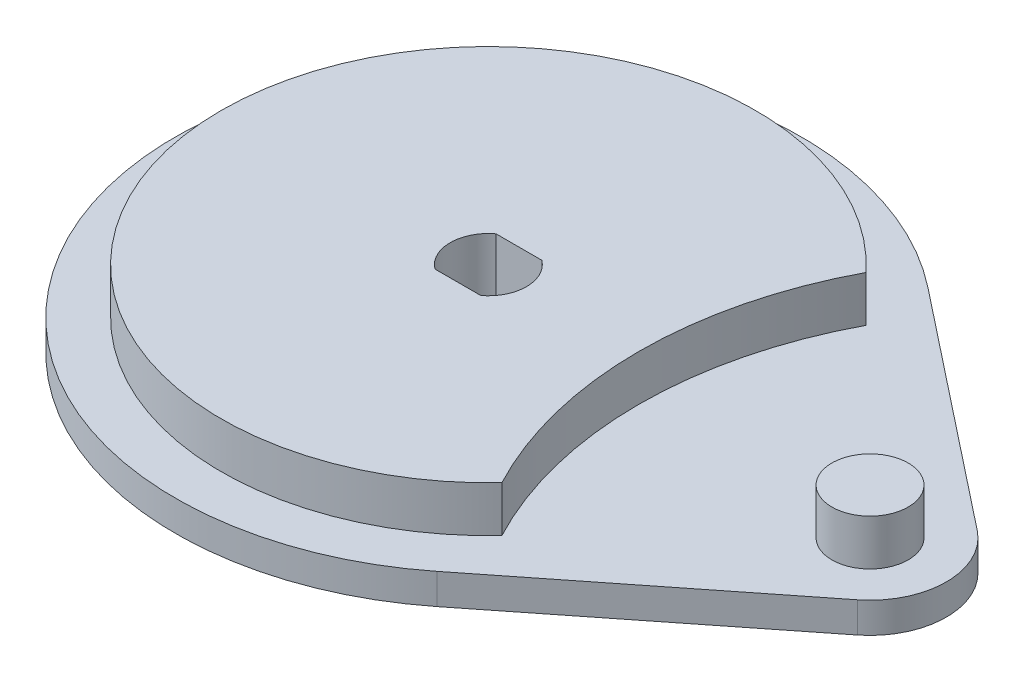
ISO-10303-21;
HEADER;
FILE_DESCRIPTION(('STEP AP214'),'2;1');
FILE_NAME('part.step','',(''),(''),'','','');
FILE_SCHEMA(('AUTOMOTIVE_DESIGN { 1 0 10303 214 1 1 1 1 }'));
ENDSEC;
DATA;
#1=APPLICATION_CONTEXT('core data for automotive mechanical design processes');
#2=APPLICATION_PROTOCOL_DEFINITION('international standard','automotive_design',2000,#1);
#3=PRODUCT_CONTEXT('',#1,'mechanical');
#4=PRODUCT('Part','Part','',(#3));
#5=PRODUCT_RELATED_PRODUCT_CATEGORY('part','',(#4));
#6=PRODUCT_DEFINITION_FORMATION('','',#4);
#7=PRODUCT_DEFINITION_CONTEXT('part definition',#1,'design');
#8=PRODUCT_DEFINITION('design','',#6,#7);
#9=PRODUCT_DEFINITION_SHAPE('','',#8);
#10=(LENGTH_UNIT() NAMED_UNIT(*) SI_UNIT(.MILLI.,.METRE.));
#11=(NAMED_UNIT(*) PLANE_ANGLE_UNIT() SI_UNIT($,.RADIAN.));
#12=(NAMED_UNIT(*) SI_UNIT($,.STERADIAN.) SOLID_ANGLE_UNIT());
#13=UNCERTAINTY_MEASURE_WITH_UNIT(LENGTH_MEASURE(1.E-05),#10,'distance_accuracy_value','');
#14=(GEOMETRIC_REPRESENTATION_CONTEXT(3) GLOBAL_UNCERTAINTY_ASSIGNED_CONTEXT((#13)) GLOBAL_UNIT_ASSIGNED_CONTEXT((#10,
#11,#12)) REPRESENTATION_CONTEXT('',''));
#15=CARTESIAN_POINT('',(0.,0.,0.));
#16=DIRECTION('',(0.,0.,1.));
#17=DIRECTION('',(1.,0.,0.));
#18=AXIS2_PLACEMENT_3D('',#15,#16,#17);
#19=CARTESIAN_POINT('',(0.,4.,0.));
#20=DIRECTION('',(0.,1.,0.));
#21=DIRECTION('',(0.,0.,1.));
#22=AXIS2_PLACEMENT_3D('',#19,#20,#21);
#23=PLANE('',#22);
#24=DIRECTION('',(-0.784601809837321,0.,-0.62));
#25=VECTOR('',#24,1.);
#26=CARTESIAN_POINT('',(25.42,4.,-32.1686742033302));
#27=LINE('',#26,#25);
#28=CARTESIAN_POINT('',(56.2,4.,-7.84601809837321));
#29=VERTEX_POINT('',#28);
#30=CARTESIAN_POINT('',(25.42,4.,-32.1686742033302));
#31=VERTEX_POINT('',#30);
#32=EDGE_CURVE('E177',#29,#31,#27,.T.);
#33=ORIENTED_EDGE('',*,*,#32,.T.);
#34=CARTESIAN_POINT('',(0.,4.,0.));
#35=DIRECTION('',(0.,1.,0.));
#36=DIRECTION('',(0.,0.,1.));
#37=AXIS2_PLACEMENT_3D('',#34,#35,#36);
#38=CIRCLE('',#37,41.);
#39=CARTESIAN_POINT('',(25.42,4.,32.1686742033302));
#40=VERTEX_POINT('',#39);
#41=EDGE_CURVE('E169',#31,#40,#38,.T.);
#42=ORIENTED_EDGE('',*,*,#41,.T.);
#43=DIRECTION('',(0.784601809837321,0.,-0.62));
#44=VECTOR('',#43,1.);
#45=CARTESIAN_POINT('',(56.2,4.,7.8460180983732));
#46=LINE('',#45,#44);
#47=CARTESIAN_POINT('',(56.2,4.,7.84601809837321));
#48=VERTEX_POINT('',#47);
#49=EDGE_CURVE('E172',#40,#48,#46,.T.);
#50=ORIENTED_EDGE('',*,*,#49,.T.);
#51=CARTESIAN_POINT('',(50.,4.,0.));
#52=DIRECTION('',(0.,1.,0.));
#53=DIRECTION('',(0.,0.,1.));
#54=AXIS2_PLACEMENT_3D('',#51,#52,#53);
#55=CIRCLE('',#54,9.99999999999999);
#56=EDGE_CURVE('E175',#48,#29,#55,.T.);
#57=ORIENTED_EDGE('',*,*,#56,.T.);
#58=EDGE_LOOP('',(#33,#42,#50,#57));
#59=FACE_BOUND('',#58,.T.);
#60=CARTESIAN_POINT('',(0.,4.,0.));
#61=DIRECTION('',(0.,1.,0.));
#62=DIRECTION('',(0.,0.,1.));
#63=AXIS2_PLACEMENT_3D('',#60,#61,#62);
#64=CIRCLE('',#63,35.);
#65=CARTESIAN_POINT('',(25.6187411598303,4.,23.8470145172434));
#66=VERTEX_POINT('',#65);
#67=CARTESIAN_POINT('',(25.6187411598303,4.,-23.8470145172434));
#68=VERTEX_POINT('',#67);
#69=EDGE_CURVE('E165',#66,#68,#64,.F.);
#70=ORIENTED_EDGE('',*,*,#69,.T.);
#71=CARTESIAN_POINT('',(70.7,4.,0.));
#72=DIRECTION('',(0.,1.,0.));
#73=DIRECTION('',(0.,0.,1.));
#74=AXIS2_PLACEMENT_3D('',#71,#72,#73);
#75=CIRCLE('',#74,51.);
#76=EDGE_CURVE('E154',#66,#68,#75,.F.);
#77=ORIENTED_EDGE('',*,*,#76,.F.);
#78=EDGE_LOOP('',(#70,#77));
#79=FACE_BOUND('',#78,.T.);
#80=CARTESIAN_POINT('',(50.,4.,0.));
#81=DIRECTION('',(0.,1.,0.));
#82=DIRECTION('',(0.,0.,1.));
#83=AXIS2_PLACEMENT_3D('',#80,#81,#82);
#84=CIRCLE('',#83,5.);
#85=CARTESIAN_POINT('',(50.,4.,5.));
#86=VERTEX_POINT('',#85);
#87=EDGE_CURVE('E149',#86,#86,#84,.F.);
#88=ORIENTED_EDGE('',*,*,#87,.T.);
#89=EDGE_LOOP('',(#88));
#90=FACE_BOUND('',#89,.T.);
#91=ADVANCED_FACE('F33',(#59,#79,#90),#23,.T.);
#92=CARTESIAN_POINT('',(0.,4.,0.));
#93=DIRECTION('',(0.,-1.,0.));
#94=DIRECTION('',(0.,0.,-1.));
#95=AXIS2_PLACEMENT_3D('',#92,#93,#94);
#96=CYLINDRICAL_SURFACE('',#95,41.);
#97=CARTESIAN_POINT('',(0.,0.,0.));
#98=DIRECTION('',(0.,1.,0.));
#99=DIRECTION('',(0.,0.,1.));
#100=AXIS2_PLACEMENT_3D('',#97,#98,#99);
#101=CIRCLE('',#100,41.);
#102=CARTESIAN_POINT('',(25.42,0.,-32.1686742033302));
#103=VERTEX_POINT('',#102);
#104=CARTESIAN_POINT('',(25.42,0.,32.1686742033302));
#105=VERTEX_POINT('',#104);
#106=EDGE_CURVE('E168',#103,#105,#101,.T.);
#107=ORIENTED_EDGE('',*,*,#106,.T.);
#108=DIRECTION('',(0.,-1.,0.));
#109=VECTOR('',#108,1.);
#110=CARTESIAN_POINT('',(25.42,4.,32.1686742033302));
#111=LINE('',#110,#109);
#112=EDGE_CURVE('E11',#40,#105,#111,.T.);
#113=ORIENTED_EDGE('',*,*,#112,.F.);
#114=ORIENTED_EDGE('',*,*,#41,.F.);
#115=DIRECTION('',(0.,-1.,0.));
#116=VECTOR('',#115,1.);
#117=CARTESIAN_POINT('',(25.42,4.,-32.1686742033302));
#118=LINE('',#117,#116);
#119=EDGE_CURVE('E179',#31,#103,#118,.T.);
#120=ORIENTED_EDGE('',*,*,#119,.T.);
#121=EDGE_LOOP('',(#107,#113,#114,#120));
#122=FACE_BOUND('',#121,.T.);
#123=ADVANCED_FACE('F35',(#122),#96,.T.);
#124=CARTESIAN_POINT('',(56.2,4.,7.8460180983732));
#125=DIRECTION('',(-0.62,0.,-0.784601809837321));
#126=DIRECTION('',(-0.784601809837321,0.,0.62));
#127=AXIS2_PLACEMENT_3D('',#124,#125,#126);
#128=PLANE('',#127);
#129=DIRECTION('',(0.784601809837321,0.,-0.62));
#130=VECTOR('',#129,1.);
#131=CARTESIAN_POINT('',(56.2,0.,7.8460180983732));
#132=LINE('',#131,#130);
#133=CARTESIAN_POINT('',(56.2,0.,7.84601809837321));
#134=VERTEX_POINT('',#133);
#135=EDGE_CURVE('E182',#105,#134,#132,.T.);
#136=ORIENTED_EDGE('',*,*,#135,.T.);
#137=DIRECTION('',(0.,-1.,0.));
#138=VECTOR('',#137,1.);
#139=CARTESIAN_POINT('',(56.2,4.,7.84601809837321));
#140=LINE('',#139,#138);
#141=EDGE_CURVE('E41',#48,#134,#140,.T.);
#142=ORIENTED_EDGE('',*,*,#141,.F.);
#143=ORIENTED_EDGE('',*,*,#49,.F.);
#144=ORIENTED_EDGE('',*,*,#112,.T.);
#145=EDGE_LOOP('',(#136,#142,#143,#144));
#146=FACE_BOUND('',#145,.T.);
#147=ADVANCED_FACE('F210',(#146),#128,.F.);
#148=CARTESIAN_POINT('',(50.,4.,0.));
#149=DIRECTION('',(0.,-1.,0.));
#150=DIRECTION('',(0.,0.,-1.));
#151=AXIS2_PLACEMENT_3D('',#148,#149,#150);
#152=CYLINDRICAL_SURFACE('',#151,9.99999999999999);
#153=CARTESIAN_POINT('',(50.,0.,0.));
#154=DIRECTION('',(0.,1.,0.));
#155=DIRECTION('',(0.,0.,1.));
#156=AXIS2_PLACEMENT_3D('',#153,#154,#155);
#157=CIRCLE('',#156,9.99999999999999);
#158=CARTESIAN_POINT('',(56.2,0.,-7.84601809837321));
#159=VERTEX_POINT('',#158);
#160=EDGE_CURVE('E184',#134,#159,#157,.T.);
#161=ORIENTED_EDGE('',*,*,#160,.T.);
#162=DIRECTION('',(0.,-1.,0.));
#163=VECTOR('',#162,1.);
#164=CARTESIAN_POINT('',(56.2,4.,-7.84601809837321));
#165=LINE('',#164,#163);
#166=EDGE_CURVE('E189',#29,#159,#165,.T.);
#167=ORIENTED_EDGE('',*,*,#166,.F.);
#168=ORIENTED_EDGE('',*,*,#56,.F.);
#169=ORIENTED_EDGE('',*,*,#141,.T.);
#170=EDGE_LOOP('',(#161,#167,#168,#169));
#171=FACE_BOUND('',#170,.T.);
#172=ADVANCED_FACE('F196',(#171),#152,.T.);
#173=CARTESIAN_POINT('',(25.42,4.,-32.1686742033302));
#174=DIRECTION('',(-0.62,0.,0.784601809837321));
#175=DIRECTION('',(0.784601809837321,0.,0.62));
#176=AXIS2_PLACEMENT_3D('',#173,#174,#175);
#177=PLANE('',#176);
#178=DIRECTION('',(-0.784601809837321,0.,-0.62));
#179=VECTOR('',#178,1.);
#180=CARTESIAN_POINT('',(25.42,0.,-32.1686742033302));
#181=LINE('',#180,#179);
#182=EDGE_CURVE('E173',#159,#103,#181,.T.);
#183=ORIENTED_EDGE('',*,*,#182,.T.);
#184=ORIENTED_EDGE('',*,*,#119,.F.);
#185=ORIENTED_EDGE('',*,*,#32,.F.);
#186=ORIENTED_EDGE('',*,*,#166,.T.);
#187=EDGE_LOOP('',(#183,#184,#185,#186));
#188=FACE_BOUND('',#187,.T.);
#189=ADVANCED_FACE('F203',(#188),#177,.F.);
#190=CARTESIAN_POINT('',(0.,0.,0.));
#191=DIRECTION('',(0.,1.,0.));
#192=DIRECTION('',(0.,0.,1.));
#193=AXIS2_PLACEMENT_3D('',#190,#191,#192);
#194=PLANE('',#193);
#195=DIRECTION('',(-1.,0.,0.));
#196=VECTOR('',#195,1.);
#197=CARTESIAN_POINT('',(-3.,0.,-4.));
#198=LINE('',#197,#196);
#199=CARTESIAN_POINT('',(3.,0.,-4.));
#200=VERTEX_POINT('',#199);
#201=CARTESIAN_POINT('',(-3.,0.,-4.));
#202=VERTEX_POINT('',#201);
#203=EDGE_CURVE('E118',#200,#202,#198,.T.);
#204=ORIENTED_EDGE('',*,*,#203,.T.);
#205=CARTESIAN_POINT('',(0.,0.,0.));
#206=DIRECTION('',(0.,1.,0.));
#207=DIRECTION('',(0.,0.,1.));
#208=AXIS2_PLACEMENT_3D('',#205,#206,#207);
#209=CIRCLE('',#208,5.);
#210=CARTESIAN_POINT('',(-3.,0.,4.));
#211=VERTEX_POINT('',#210);
#212=EDGE_CURVE('E112',#202,#211,#209,.T.);
#213=ORIENTED_EDGE('',*,*,#212,.T.);
#214=DIRECTION('',(1.,0.,0.));
#215=VECTOR('',#214,1.);
#216=CARTESIAN_POINT('',(-3.,0.,4.));
#217=LINE('',#216,#215);
#218=CARTESIAN_POINT('',(3.,0.,4.));
#219=VERTEX_POINT('',#218);
#220=EDGE_CURVE('E121',#211,#219,#217,.T.);
#221=ORIENTED_EDGE('',*,*,#220,.T.);
#222=CARTESIAN_POINT('',(0.,0.,0.));
#223=DIRECTION('',(0.,1.,0.));
#224=DIRECTION('',(0.,0.,1.));
#225=AXIS2_PLACEMENT_3D('',#222,#223,#224);
#226=CIRCLE('',#225,5.);
#227=EDGE_CURVE('E48',#219,#200,#226,.T.);
#228=ORIENTED_EDGE('',*,*,#227,.T.);
#229=EDGE_LOOP('',(#204,#213,#221,#228));
#230=FACE_BOUND('',#229,.T.);
#231=ORIENTED_EDGE('',*,*,#106,.F.);
#232=ORIENTED_EDGE('',*,*,#182,.F.);
#233=ORIENTED_EDGE('',*,*,#160,.F.);
#234=ORIENTED_EDGE('',*,*,#135,.F.);
#235=EDGE_LOOP('',(#231,#232,#233,#234));
#236=FACE_BOUND('',#235,.T.);
#237=ADVANCED_FACE('F125',(#230,#236),#194,.F.);
#238=CARTESIAN_POINT('',(0.,10.,0.));
#239=DIRECTION('',(0.,-1.,0.));
#240=DIRECTION('',(0.,0.,-1.));
#241=AXIS2_PLACEMENT_3D('',#238,#239,#240);
#242=CYLINDRICAL_SURFACE('',#241,35.);
#243=ORIENTED_EDGE('',*,*,#69,.F.);
#244=DIRECTION('',(0.,1.,0.));
#245=VECTOR('',#244,1.);
#246=CARTESIAN_POINT('',(25.6187411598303,7.00000000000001,23.8470145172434));
#247=LINE('',#246,#245);
#248=CARTESIAN_POINT('',(25.6187411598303,10.,23.8470145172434));
#249=VERTEX_POINT('',#248);
#250=EDGE_CURVE('E159',#66,#249,#247,.T.);
#251=ORIENTED_EDGE('',*,*,#250,.T.);
#252=CARTESIAN_POINT('',(0.,10.,0.));
#253=DIRECTION('',(0.,1.,0.));
#254=DIRECTION('',(0.,0.,1.));
#255=AXIS2_PLACEMENT_3D('',#252,#253,#254);
#256=CIRCLE('',#255,35.);
#257=CARTESIAN_POINT('',(25.6187411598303,10.,-23.8470145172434));
#258=VERTEX_POINT('',#257);
#259=EDGE_CURVE('E162',#258,#249,#256,.T.);
#260=ORIENTED_EDGE('',*,*,#259,.F.);
#261=DIRECTION('',(0.,1.,0.));
#262=VECTOR('',#261,1.);
#263=CARTESIAN_POINT('',(25.6187411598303,7.00000000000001,-23.8470145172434));
#264=LINE('',#263,#262);
#265=EDGE_CURVE('E156',#258,#68,#264,.F.);
#266=ORIENTED_EDGE('',*,*,#265,.T.);
#267=EDGE_LOOP('',(#243,#251,#260,#266));
#268=FACE_BOUND('',#267,.T.);
#269=ADVANCED_FACE('F223',(#268),#242,.T.);
#270=CARTESIAN_POINT('',(0.,10.,0.));
#271=DIRECTION('',(0.,1.,0.));
#272=DIRECTION('',(0.,0.,1.));
#273=AXIS2_PLACEMENT_3D('',#270,#271,#272);
#274=PLANE('',#273);
#275=CARTESIAN_POINT('',(0.,10.,0.));
#276=DIRECTION('',(0.,1.,0.));
#277=DIRECTION('',(0.,0.,1.));
#278=AXIS2_PLACEMENT_3D('',#275,#276,#277);
#279=CIRCLE('',#278,5.);
#280=CARTESIAN_POINT('',(-3.,10.,-4.));
#281=VERTEX_POINT('',#280);
#282=CARTESIAN_POINT('',(-3.,10.,4.));
#283=VERTEX_POINT('',#282);
#284=EDGE_CURVE('E56',#281,#283,#279,.T.);
#285=ORIENTED_EDGE('',*,*,#284,.F.);
#286=DIRECTION('',(-1.,0.,0.));
#287=VECTOR('',#286,1.);
#288=CARTESIAN_POINT('',(-3.,10.,-4.));
#289=LINE('',#288,#287);
#290=CARTESIAN_POINT('',(3.,10.,-4.));
#291=VERTEX_POINT('',#290);
#292=EDGE_CURVE('E128',#291,#281,#289,.T.);
#293=ORIENTED_EDGE('',*,*,#292,.F.);
#294=CARTESIAN_POINT('',(0.,10.,0.));
#295=DIRECTION('',(0.,1.,0.));
#296=DIRECTION('',(0.,0.,1.));
#297=AXIS2_PLACEMENT_3D('',#294,#295,#296);
#298=CIRCLE('',#297,5.);
#299=CARTESIAN_POINT('',(3.,10.,4.));
#300=VERTEX_POINT('',#299);
#301=EDGE_CURVE('E131',#300,#291,#298,.T.);
#302=ORIENTED_EDGE('',*,*,#301,.F.);
#303=DIRECTION('',(1.,0.,0.));
#304=VECTOR('',#303,1.);
#305=CARTESIAN_POINT('',(-3.,10.,4.));
#306=LINE('',#305,#304);
#307=EDGE_CURVE('E137',#283,#300,#306,.T.);
#308=ORIENTED_EDGE('',*,*,#307,.F.);
#309=EDGE_LOOP('',(#285,#293,#302,#308));
#310=FACE_BOUND('',#309,.T.);
#311=CARTESIAN_POINT('',(70.7,10.,0.));
#312=DIRECTION('',(0.,1.,0.));
#313=DIRECTION('',(0.,0.,1.));
#314=AXIS2_PLACEMENT_3D('',#311,#312,#313);
#315=CIRCLE('',#314,51.);
#316=EDGE_CURVE('E152',#258,#249,#315,.T.);
#317=ORIENTED_EDGE('',*,*,#316,.F.);
#318=ORIENTED_EDGE('',*,*,#259,.T.);
#319=EDGE_LOOP('',(#317,#318));
#320=FACE_BOUND('',#319,.T.);
#321=ADVANCED_FACE('F244',(#310,#320),#274,.T.);
#322=CARTESIAN_POINT('',(70.7,-140.249783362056,0.));
#323=DIRECTION('',(0.,1.,0.));
#324=DIRECTION('',(0.,0.,1.));
#325=AXIS2_PLACEMENT_3D('',#322,#323,#324);
#326=CYLINDRICAL_SURFACE('',#325,51.);
#327=ORIENTED_EDGE('',*,*,#76,.T.);
#328=ORIENTED_EDGE('',*,*,#265,.F.);
#329=ORIENTED_EDGE('',*,*,#316,.T.);
#330=ORIENTED_EDGE('',*,*,#250,.F.);
#331=EDGE_LOOP('',(#327,#328,#329,#330));
#332=FACE_BOUND('',#331,.T.);
#333=ADVANCED_FACE('F251',(#332),#326,.F.);
#334=CARTESIAN_POINT('',(50.,10.,0.));
#335=DIRECTION('',(0.,-1.,0.));
#336=DIRECTION('',(0.,0.,-1.));
#337=AXIS2_PLACEMENT_3D('',#334,#335,#336);
#338=CYLINDRICAL_SURFACE('',#337,5.);
#339=ORIENTED_EDGE('',*,*,#87,.F.);
#340=EDGE_LOOP('',(#339));
#341=FACE_BOUND('',#340,.T.);
#342=CARTESIAN_POINT('',(50.,10.,0.));
#343=DIRECTION('',(0.,1.,0.));
#344=DIRECTION('',(0.,0.,1.));
#345=AXIS2_PLACEMENT_3D('',#342,#343,#344);
#346=CIRCLE('',#345,5.);
#347=CARTESIAN_POINT('',(50.,10.,5.));
#348=VERTEX_POINT('',#347);
#349=EDGE_CURVE('E143',#348,#348,#346,.T.);
#350=ORIENTED_EDGE('',*,*,#349,.F.);
#351=EDGE_LOOP('',(#350));
#352=FACE_BOUND('',#351,.T.);
#353=ADVANCED_FACE('F258',(#341,#352),#338,.T.);
#354=CARTESIAN_POINT('',(50.,10.,0.));
#355=DIRECTION('',(0.,1.,0.));
#356=DIRECTION('',(0.,0.,1.));
#357=AXIS2_PLACEMENT_3D('',#354,#355,#356);
#358=PLANE('',#357);
#359=ORIENTED_EDGE('',*,*,#349,.T.);
#360=EDGE_LOOP('',(#359));
#361=FACE_BOUND('',#360,.T.);
#362=ADVANCED_FACE('F266',(#361),#358,.T.);
#363=CARTESIAN_POINT('',(0.,0.,0.));
#364=DIRECTION('',(0.,1.,0.));
#365=DIRECTION('',(0.,0.,1.));
#366=AXIS2_PLACEMENT_3D('',#363,#364,#365);
#367=CYLINDRICAL_SURFACE('',#366,5.);
#368=ORIENTED_EDGE('',*,*,#284,.T.);
#369=DIRECTION('',(0.,1.,0.));
#370=VECTOR('',#369,1.);
#371=CARTESIAN_POINT('',(-3.,0.,4.));
#372=LINE('',#371,#370);
#373=EDGE_CURVE('E108',#211,#283,#372,.T.);
#374=ORIENTED_EDGE('',*,*,#373,.F.);
#375=ORIENTED_EDGE('',*,*,#212,.F.);
#376=DIRECTION('',(0.,1.,0.));
#377=VECTOR('',#376,1.);
#378=CARTESIAN_POINT('',(-3.,0.,-4.));
#379=LINE('',#378,#377);
#380=EDGE_CURVE('E141',#202,#281,#379,.T.);
#381=ORIENTED_EDGE('',*,*,#380,.T.);
#382=EDGE_LOOP('',(#368,#374,#375,#381));
#383=FACE_BOUND('',#382,.T.);
#384=ADVANCED_FACE('F110',(#383),#367,.F.);
#385=CARTESIAN_POINT('',(-3.,0.,-4.));
#386=DIRECTION('',(0.,0.,-1.));
#387=DIRECTION('',(-1.,0.,0.));
#388=AXIS2_PLACEMENT_3D('',#385,#386,#387);
#389=PLANE('',#388);
#390=ORIENTED_EDGE('',*,*,#292,.T.);
#391=ORIENTED_EDGE('',*,*,#380,.F.);
#392=ORIENTED_EDGE('',*,*,#203,.F.);
#393=DIRECTION('',(0.,1.,0.));
#394=VECTOR('',#393,1.);
#395=CARTESIAN_POINT('',(3.,0.,-4.));
#396=LINE('',#395,#394);
#397=EDGE_CURVE('E144',#200,#291,#396,.T.);
#398=ORIENTED_EDGE('',*,*,#397,.T.);
#399=EDGE_LOOP('',(#390,#391,#392,#398));
#400=FACE_BOUND('',#399,.T.);
#401=ADVANCED_FACE('F279',(#400),#389,.F.);
#402=CARTESIAN_POINT('',(0.,0.,0.));
#403=DIRECTION('',(0.,1.,0.));
#404=DIRECTION('',(0.,0.,1.));
#405=AXIS2_PLACEMENT_3D('',#402,#403,#404);
#406=CYLINDRICAL_SURFACE('',#405,5.);
#407=ORIENTED_EDGE('',*,*,#301,.T.);
#408=ORIENTED_EDGE('',*,*,#397,.F.);
#409=ORIENTED_EDGE('',*,*,#227,.F.);
#410=DIRECTION('',(0.,1.,0.));
#411=VECTOR('',#410,1.);
#412=CARTESIAN_POINT('',(3.,0.,4.));
#413=LINE('',#412,#411);
#414=EDGE_CURVE('E117',#219,#300,#413,.T.);
#415=ORIENTED_EDGE('',*,*,#414,.T.);
#416=EDGE_LOOP('',(#407,#408,#409,#415));
#417=FACE_BOUND('',#416,.T.);
#418=ADVANCED_FACE('F286',(#417),#406,.F.);
#419=CARTESIAN_POINT('',(-3.,0.,4.));
#420=DIRECTION('',(0.,0.,1.));
#421=DIRECTION('',(1.,0.,0.));
#422=AXIS2_PLACEMENT_3D('',#419,#420,#421);
#423=PLANE('',#422);
#424=ORIENTED_EDGE('',*,*,#307,.T.);
#425=ORIENTED_EDGE('',*,*,#414,.F.);
#426=ORIENTED_EDGE('',*,*,#220,.F.);
#427=ORIENTED_EDGE('',*,*,#373,.T.);
#428=EDGE_LOOP('',(#424,#425,#426,#427));
#429=FACE_BOUND('',#428,.T.);
#430=ADVANCED_FACE('F122',(#429),#423,.F.);
#431=CLOSED_SHELL('',(#91,#123,#147,#172,#189,#237,#269,#321,#333,#353,#362,#384,#401,#418,#430));
#432=MANIFOLD_SOLID_BREP('B2',#431);
#433=ADVANCED_BREP_SHAPE_REPRESENTATION('',(#18,#432),#14);
#434=SHAPE_DEFINITION_REPRESENTATION(#9,#433);
ENDSEC;
END-ISO-10303-21;
